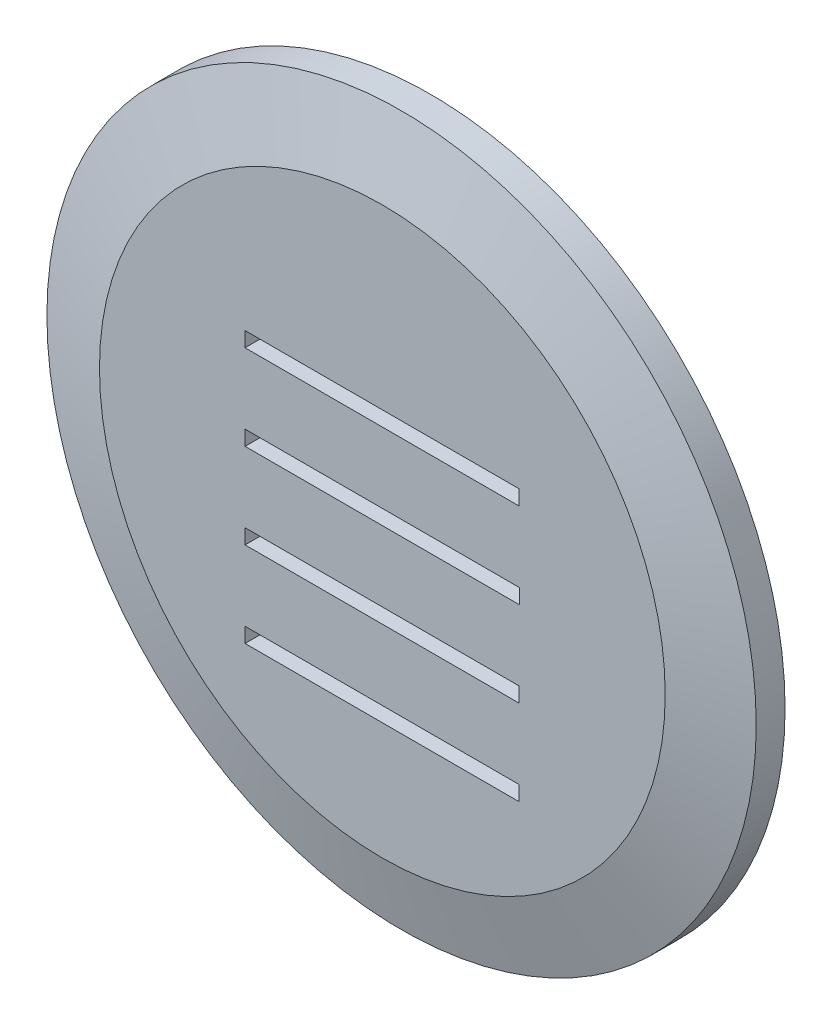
from build123d import *

# Parameters (mm, degrees)
SKETCH2_W          = 29.0068
SKETCH2_H          = 1.5748
SKETCH2_W_2        = 28.956
CUT_EXTRUDE1_DEPTH = 54.226486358


with BuildPart() as part:
    # Sketch1 → Revolve1 (revolve)
    with BuildSketch(Plane(origin=(0, 0, 0), x_dir=(1, 0, 0), z_dir=(0, 1, 0))):
        Polygon((23.0505, 2.54), (0, 2.54), (0, -2.54), (29.881472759, -2.54), (37.465, -0.508), (37.465, 2.54), (26.2255, 2.54), (26.2255, -0.127), (23.0505, -0.127), align=None)
    revolve(axis=Axis((0, 0, -2.54), (0, 0, 1)))

    # Sketch2 → Cut-Extrude1 (cut, through all)
    with BuildSketch(Plane.XY.offset(2.54)):
        with Locations((0, 1.3208)):
            Rectangle(SKETCH2_W, SKETCH2_H)
        with Locations((-0.0254, 10.3378)):
            Rectangle(SKETCH2_W_2, SKETCH2_H)
        with Locations((-0.0254, -7.6962)):
            Rectangle(SKETCH2_W_2, SKETCH2_H)
        with Locations((-0.0254, -16.7132)):
            Rectangle(SKETCH2_W_2, SKETCH2_H)
    extrude(amount=-CUT_EXTRUDE1_DEPTH, mode=Mode.SUBTRACT)


solid = part.part
